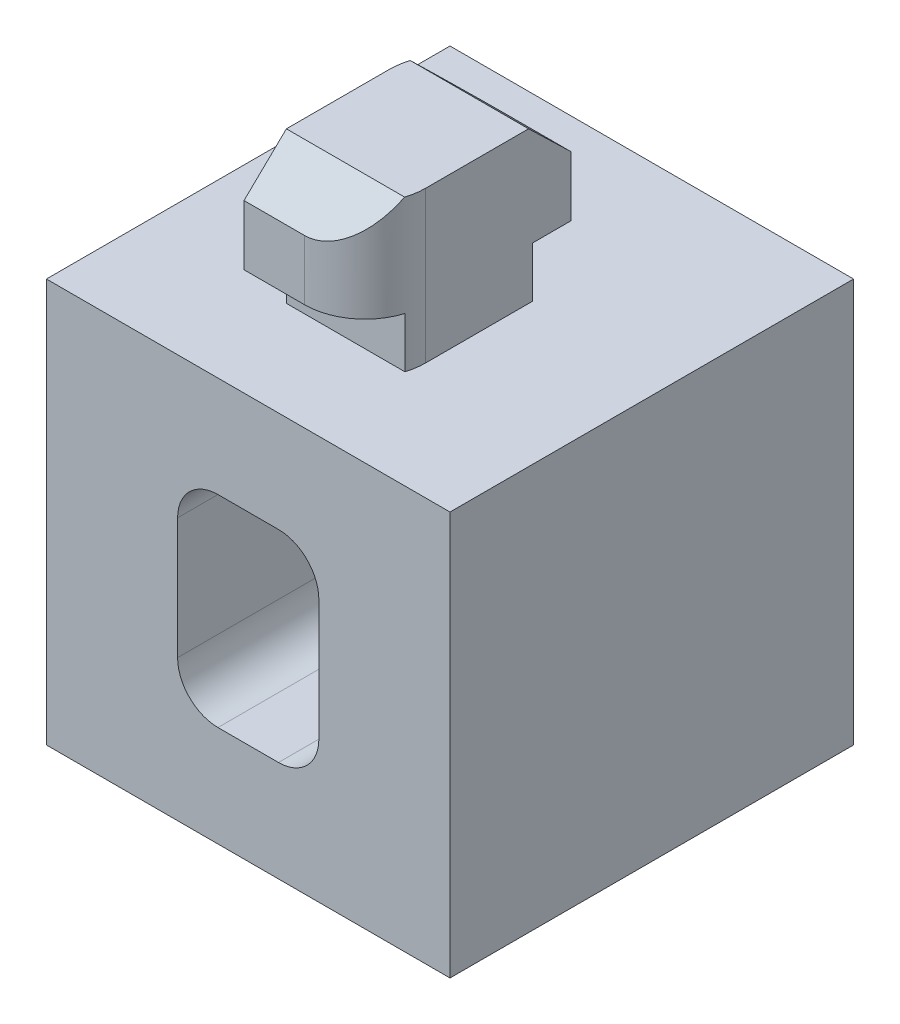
from build123d import *

# Parameters (mm, degrees)
SKETCH_1_W          = 20
SKETCH_1_H          = 20
EXTRUDE_1_DEPTH     = 10
EXTRUDE_2_DEPTH     = 3
CUT_EXTRUDE_1_DEPTH = 2.7
FILLET_2_R          = 3


with BuildPart() as part:
    # Sketch 1 → Extrude 1 (new, symmetric)
    with BuildSketch(Plane.XY):
        Rectangle(SKETCH_1_W, SKETCH_1_H)
        with BuildLine():
            Line((-1.5, 5), (1.5, 5))
            ThreePointArc((1.5, 5), (2.914213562, 4.414213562), (3.5, 3))
            Line((3.5, 3), (3.5, -3))
            ThreePointArc((3.5, -3), (2.914213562, -4.414213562), (1.5, -5))
            Line((1.5, -5), (-1.5, -5))
            ThreePointArc((-1.5, -5), (-2.914213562, -4.414213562), (-3.5, -3))
            Line((-3.5, -3), (-3.5, 3))
            ThreePointArc((-3.5, 3), (-2.914213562, 4.414213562), (-1.5, 5))
        make_face(mode=Mode.SUBTRACT)
    extrude(amount=EXTRUDE_1_DEPTH, both=True)

    # Sketch 4 → Extrude 2 (add, symmetric)
    with BuildSketch(Plane(origin=(0, 0, 0), x_dir=(0, 0, -1), z_dir=(1, 0, 0))):
        Polygon((-5.1, 10), (1.1, 10), (1.1, 12.5), (2.991927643, 12.5), (2.991927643, 15.472053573), (0.891927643, 17.5), (-5.108072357, 17.5), (-7.208072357, 15.472053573), (-7.208072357, 12.5), (-5.1, 12.5), align=None)
    extrude(amount=EXTRUDE_2_DEPTH, both=True)

    # Sketch 6 → Cut-Extrude 1 (cut, symmetric)
    with BuildSketch(Plane.XY):
        with BuildLine():
            Line((-5.15, -10), (-5.15, -8.5))
            ThreePointArc((-5.15, -8.5), (-4.85, -8), (-5.15, -7.5))
            Line((-5.15, -7.5), (-5.15, 7))
            Line((-5.15, 7), (5.15, 7))
            Line((5.15, 7), (5.15, -7.5))
            ThreePointArc((5.15, -7.5), (4.85, -8), (5.15, -8.5))
            Line((5.15, -8.5), (5.15, -10))
            Line((5.15, -10), (-5.15, -10))
        make_face()
    extrude(amount=CUT_EXTRUDE_1_DEPTH, both=True, mode=Mode.SUBTRACT)

    # Fillet 2
    fillet_2_edges = [part.edges().sort_by_distance(p)[0] for p in [
        (3, 13.986026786, 7.208072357),
        (-3, 13.986026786, -2.991927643),
    ]]
    fillet(fillet_2_edges, radius=FILLET_2_R)


solid = part.part
